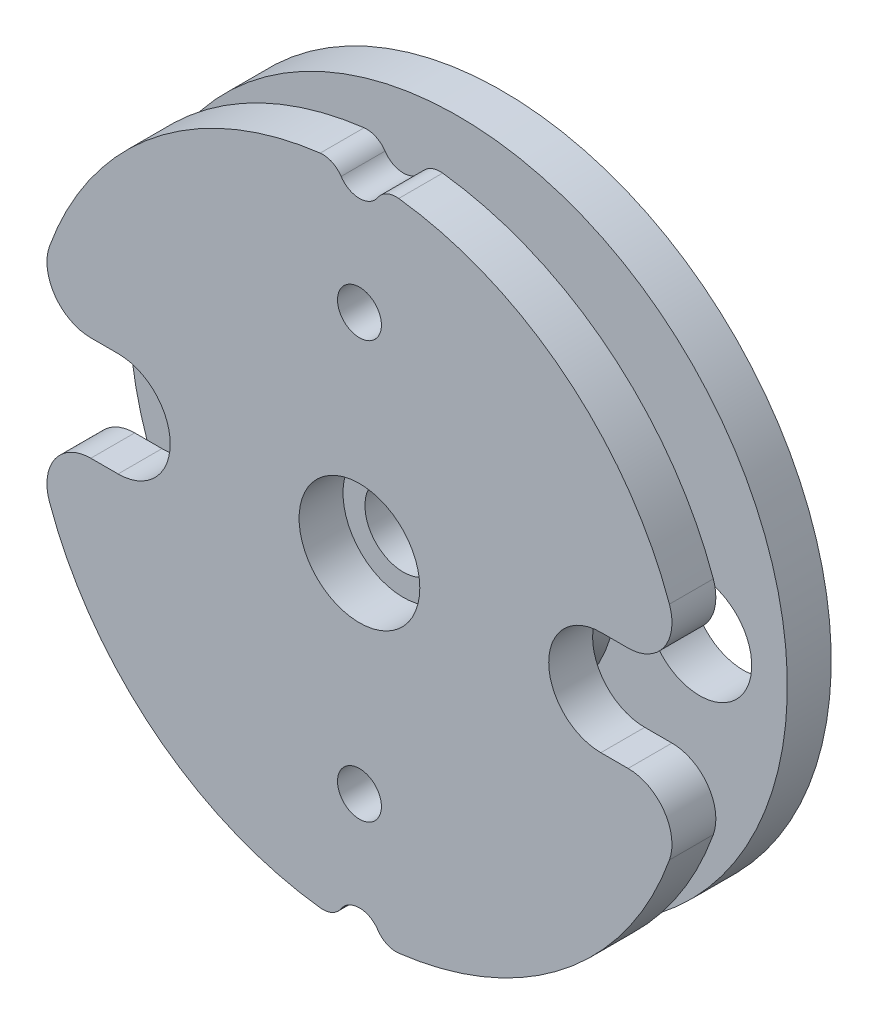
ISO-10303-21;
HEADER;
FILE_DESCRIPTION(('STEP AP214'),'2;1');
FILE_NAME('part.step','',(''),(''),'','','');
FILE_SCHEMA(('AUTOMOTIVE_DESIGN { 1 0 10303 214 1 1 1 1 }'));
ENDSEC;
DATA;
#1=APPLICATION_CONTEXT('core data for automotive mechanical design processes');
#2=APPLICATION_PROTOCOL_DEFINITION('international standard','automotive_design',2000,#1);
#3=PRODUCT_CONTEXT('',#1,'mechanical');
#4=PRODUCT('Part','Part','',(#3));
#5=PRODUCT_RELATED_PRODUCT_CATEGORY('part','',(#4));
#6=PRODUCT_DEFINITION_FORMATION('','',#4);
#7=PRODUCT_DEFINITION_CONTEXT('part definition',#1,'design');
#8=PRODUCT_DEFINITION('design','',#6,#7);
#9=PRODUCT_DEFINITION_SHAPE('','',#8);
#10=(LENGTH_UNIT() NAMED_UNIT(*) SI_UNIT(.MILLI.,.METRE.));
#11=(NAMED_UNIT(*) PLANE_ANGLE_UNIT() SI_UNIT($,.RADIAN.));
#12=(NAMED_UNIT(*) SI_UNIT($,.STERADIAN.) SOLID_ANGLE_UNIT());
#13=UNCERTAINTY_MEASURE_WITH_UNIT(LENGTH_MEASURE(1.E-05),#10,'distance_accuracy_value','');
#14=(GEOMETRIC_REPRESENTATION_CONTEXT(3) GLOBAL_UNCERTAINTY_ASSIGNED_CONTEXT((#13)) GLOBAL_UNIT_ASSIGNED_CONTEXT((#10,
#11,#12)) REPRESENTATION_CONTEXT('',''));
#15=CARTESIAN_POINT('',(0.,0.,0.));
#16=DIRECTION('',(0.,0.,1.));
#17=DIRECTION('',(1.,0.,0.));
#18=AXIS2_PLACEMENT_3D('',#15,#16,#17);
#19=CARTESIAN_POINT('',(0.,0.,3.25));
#20=DIRECTION('',(0.,0.,-1.));
#21=DIRECTION('',(-1.,0.,0.));
#22=AXIS2_PLACEMENT_3D('',#19,#20,#21);
#23=CYLINDRICAL_SURFACE('',#22,15.);
#24=CARTESIAN_POINT('',(0.,0.,1.25));
#25=DIRECTION('',(0.,0.,1.));
#26=DIRECTION('',(1.,0.,0.));
#27=AXIS2_PLACEMENT_3D('',#24,#25,#26);
#28=CIRCLE('',#27,15.);
#29=CARTESIAN_POINT('',(-14.1250458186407,-5.04807692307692,1.25));
#30=VERTEX_POINT('',#29);
#31=CARTESIAN_POINT('',(-1.78963854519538,-14.8928571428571,1.25));
#32=VERTEX_POINT('',#31);
#33=EDGE_CURVE('E239',#30,#32,#28,.T.);
#34=ORIENTED_EDGE('',*,*,#33,.T.);
#35=DIRECTION('',(0.,0.,-1.));
#36=VECTOR('',#35,1.);
#37=CARTESIAN_POINT('',(-1.78963854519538,-14.8928571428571,3.25));
#38=LINE('',#37,#36);
#39=CARTESIAN_POINT('',(-1.78963854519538,-14.8928571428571,3.25));
#40=VERTEX_POINT('',#39);
#41=EDGE_CURVE('E328',#32,#40,#38,.F.);
#42=ORIENTED_EDGE('',*,*,#41,.T.);
#43=CARTESIAN_POINT('',(0.,0.,3.25));
#44=DIRECTION('',(0.,0.,1.));
#45=DIRECTION('',(1.,0.,0.));
#46=AXIS2_PLACEMENT_3D('',#43,#44,#45);
#47=CIRCLE('',#46,15.);
#48=CARTESIAN_POINT('',(-14.1250458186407,-5.04807692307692,3.25));
#49=VERTEX_POINT('',#48);
#50=EDGE_CURVE('E244',#49,#40,#47,.T.);
#51=ORIENTED_EDGE('',*,*,#50,.F.);
#52=DIRECTION('',(0.,0.,-1.));
#53=VECTOR('',#52,1.);
#54=CARTESIAN_POINT('',(-14.1250458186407,-5.04807692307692,3.25));
#55=LINE('',#54,#53);
#56=EDGE_CURVE('E290',#49,#30,#55,.T.);
#57=ORIENTED_EDGE('',*,*,#56,.T.);
#58=EDGE_LOOP('',(#34,#42,#51,#57));
#59=FACE_BOUND('',#58,.T.);
#60=ADVANCED_FACE('F32',(#59),#23,.T.);
#61=CARTESIAN_POINT('',(14.1250458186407,5.04807692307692,1.25));
#62=VERTEX_POINT('',#61);
#63=CARTESIAN_POINT('',(1.78963854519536,14.8928571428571,1.25));
#64=VERTEX_POINT('',#63);
#65=EDGE_CURVE('E238',#62,#64,#28,.T.);
#66=ORIENTED_EDGE('',*,*,#65,.T.);
#67=DIRECTION('',(0.,0.,-1.));
#68=VECTOR('',#67,1.);
#69=CARTESIAN_POINT('',(1.78963854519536,14.8928571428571,3.25));
#70=LINE('',#69,#68);
#71=CARTESIAN_POINT('',(1.78963854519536,14.8928571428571,3.25));
#72=VERTEX_POINT('',#71);
#73=EDGE_CURVE('E325',#64,#72,#70,.F.);
#74=ORIENTED_EDGE('',*,*,#73,.T.);
#75=CARTESIAN_POINT('',(14.1250458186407,5.04807692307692,3.25));
#76=VERTEX_POINT('',#75);
#77=EDGE_CURVE('E248',#76,#72,#47,.T.);
#78=ORIENTED_EDGE('',*,*,#77,.F.);
#79=DIRECTION('',(0.,0.,-1.));
#80=VECTOR('',#79,1.);
#81=CARTESIAN_POINT('',(14.1250458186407,5.04807692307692,3.25));
#82=LINE('',#81,#80);
#83=EDGE_CURVE('E265',#76,#62,#82,.T.);
#84=ORIENTED_EDGE('',*,*,#83,.T.);
#85=EDGE_LOOP('',(#66,#74,#78,#84));
#86=FACE_BOUND('',#85,.T.);
#87=ADVANCED_FACE('F406',(#86),#23,.T.);
#88=CARTESIAN_POINT('',(-1.78963854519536,14.8928571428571,3.25));
#89=VERTEX_POINT('',#88);
#90=CARTESIAN_POINT('',(-14.1250458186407,5.04807692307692,3.25));
#91=VERTEX_POINT('',#90);
#92=EDGE_CURVE('E246',#89,#91,#47,.T.);
#93=ORIENTED_EDGE('',*,*,#92,.F.);
#94=DIRECTION('',(0.,0.,-1.));
#95=VECTOR('',#94,1.);
#96=CARTESIAN_POINT('',(-1.78963854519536,14.8928571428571,3.25));
#97=LINE('',#96,#95);
#98=CARTESIAN_POINT('',(-1.78963854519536,14.8928571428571,1.25));
#99=VERTEX_POINT('',#98);
#100=EDGE_CURVE('E304',#89,#99,#97,.T.);
#101=ORIENTED_EDGE('',*,*,#100,.T.);
#102=CARTESIAN_POINT('',(-14.1250458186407,5.04807692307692,1.25));
#103=VERTEX_POINT('',#102);
#104=EDGE_CURVE('E242',#99,#103,#28,.T.);
#105=ORIENTED_EDGE('',*,*,#104,.T.);
#106=DIRECTION('',(0.,0.,-1.));
#107=VECTOR('',#106,1.);
#108=CARTESIAN_POINT('',(-14.1250458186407,5.04807692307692,3.25));
#109=LINE('',#108,#107);
#110=EDGE_CURVE('E282',#103,#91,#109,.F.);
#111=ORIENTED_EDGE('',*,*,#110,.T.);
#112=EDGE_LOOP('',(#93,#101,#105,#111));
#113=FACE_BOUND('',#112,.T.);
#114=ADVANCED_FACE('F460',(#113),#23,.T.);
#115=CARTESIAN_POINT('',(0.,0.,-3.25));
#116=DIRECTION('',(0.,0.,1.));
#117=DIRECTION('',(1.,0.,0.));
#118=AXIS2_PLACEMENT_3D('',#115,#116,#117);
#119=CYLINDRICAL_SURFACE('',#118,1.75);
#120=CARTESIAN_POINT('',(0.,0.,-1.45));
#121=DIRECTION('',(0.,0.,-1.));
#122=DIRECTION('',(-1.,0.,0.));
#123=AXIS2_PLACEMENT_3D('',#120,#121,#122);
#124=CIRCLE('',#123,1.75);
#125=CARTESIAN_POINT('',(1.75,0.,-1.45));
#126=VERTEX_POINT('',#125);
#127=EDGE_CURVE('E230',#126,#126,#124,.F.);
#128=CARTESIAN_POINT('',(0.,0.,1.25));
#129=DIRECTION('',(0.,0.,1.));
#130=DIRECTION('',(1.,0.,0.));
#131=AXIS2_PLACEMENT_3D('',#128,#129,#130);
#132=CIRCLE('',#131,1.75);
#133=CARTESIAN_POINT('',(1.75,0.,1.25));
#134=VERTEX_POINT('',#133);
#135=EDGE_CURVE('E224',#134,#134,#132,.F.);
#136=CARTESIAN_POINT('',(1.75,0.,-1.45));
#137=CARTESIAN_POINT('',(1.75,0.,-1.421875));
#138=CARTESIAN_POINT('',(1.75,0.,-1.39375));
#139=CARTESIAN_POINT('',(1.75,0.,-1.3375));
#140=CARTESIAN_POINT('',(1.75,0.,-1.309375));
#141=CARTESIAN_POINT('',(1.75,0.,-1.253125));
#142=CARTESIAN_POINT('',(1.75,0.,-1.225));
#143=CARTESIAN_POINT('',(1.75,0.,-1.16875));
#144=CARTESIAN_POINT('',(1.75,0.,-1.140625));
#145=CARTESIAN_POINT('',(1.75,0.,-1.084375));
#146=CARTESIAN_POINT('',(1.75,0.,-1.05625));
#147=CARTESIAN_POINT('',(1.75,0.,-1.));
#148=CARTESIAN_POINT('',(1.75,0.,-0.971875));
#149=CARTESIAN_POINT('',(1.75,0.,-0.915625));
#150=CARTESIAN_POINT('',(1.75,0.,-0.8875));
#151=CARTESIAN_POINT('',(1.75,0.,-0.83125));
#152=CARTESIAN_POINT('',(1.75,0.,-0.803125));
#153=CARTESIAN_POINT('',(1.75,0.,-0.746875));
#154=CARTESIAN_POINT('',(1.75,0.,-0.71875));
#155=CARTESIAN_POINT('',(1.75,0.,-0.6625));
#156=CARTESIAN_POINT('',(1.75,0.,-0.634375));
#157=CARTESIAN_POINT('',(1.75,0.,-0.578125));
#158=CARTESIAN_POINT('',(1.75,0.,-0.55));
#159=CARTESIAN_POINT('',(1.75,0.,-0.49375));
#160=CARTESIAN_POINT('',(1.75,0.,-0.465625));
#161=CARTESIAN_POINT('',(1.75,0.,-0.409375));
#162=CARTESIAN_POINT('',(1.75,0.,-0.38125));
#163=CARTESIAN_POINT('',(1.75,0.,-0.325));
#164=CARTESIAN_POINT('',(1.75,0.,-0.296875));
#165=CARTESIAN_POINT('',(1.75,0.,-0.240625));
#166=CARTESIAN_POINT('',(1.75,0.,-0.2125));
#167=CARTESIAN_POINT('',(1.75,0.,-0.15625));
#168=CARTESIAN_POINT('',(1.75,0.,-0.128125));
#169=CARTESIAN_POINT('',(1.75,0.,-0.0718749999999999));
#170=CARTESIAN_POINT('',(1.75,0.,-0.04375));
#171=CARTESIAN_POINT('',(1.75,0.,0.0125000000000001));
#172=CARTESIAN_POINT('',(1.75,0.,0.0406250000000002));
#173=CARTESIAN_POINT('',(1.75,0.,0.0968750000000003));
#174=CARTESIAN_POINT('',(1.75,0.,0.125));
#175=CARTESIAN_POINT('',(1.75,0.,0.18125));
#176=CARTESIAN_POINT('',(1.75,0.,0.209375));
#177=CARTESIAN_POINT('',(1.75,0.,0.265625));
#178=CARTESIAN_POINT('',(1.75,0.,0.29375));
#179=CARTESIAN_POINT('',(1.75,0.,0.35));
#180=CARTESIAN_POINT('',(1.75,0.,0.378125));
#181=CARTESIAN_POINT('',(1.75,0.,0.434375));
#182=CARTESIAN_POINT('',(1.75,0.,0.4625));
#183=CARTESIAN_POINT('',(1.75,0.,0.51875));
#184=CARTESIAN_POINT('',(1.75,0.,0.546875));
#185=CARTESIAN_POINT('',(1.75,0.,0.603125));
#186=CARTESIAN_POINT('',(1.75,0.,0.63125));
#187=CARTESIAN_POINT('',(1.75,0.,0.6875));
#188=CARTESIAN_POINT('',(1.75,0.,0.715625));
#189=CARTESIAN_POINT('',(1.75,0.,0.771875));
#190=CARTESIAN_POINT('',(1.75,0.,0.8));
#191=CARTESIAN_POINT('',(1.75,0.,0.85625));
#192=CARTESIAN_POINT('',(1.75,0.,0.884375));
#193=CARTESIAN_POINT('',(1.75,0.,0.940625));
#194=CARTESIAN_POINT('',(1.75,0.,0.96875));
#195=CARTESIAN_POINT('',(1.75,0.,1.025));
#196=CARTESIAN_POINT('',(1.75,0.,1.053125));
#197=CARTESIAN_POINT('',(1.75,0.,1.109375));
#198=CARTESIAN_POINT('',(1.75,0.,1.1375));
#199=CARTESIAN_POINT('',(1.75,0.,1.19375));
#200=CARTESIAN_POINT('',(1.75,0.,1.221875));
#201=CARTESIAN_POINT('',(1.75,0.,1.25));
#202=B_SPLINE_CURVE_WITH_KNOTS('',3,(#136,#137,#138,#139,#140,#141,#142,#143,#144,#145,#146,
#147,#148,#149,#150,#151,#152,#153,#154,#155,#156,#157,#158,#159,#160,#161,#162,#163,#164,#165,
#166,#167,#168,#169,#170,#171,#172,#173,#174,#175,#176,#177,#178,#179,#180,#181,#182,#183,#184,
#185,#186,#187,#188,#189,#190,#191,#192,#193,#194,#195,#196,#197,#198,#199,#200,#201),
.UNSPECIFIED.,.F.,.F.,(4,2,2,2,2,2,2,2,2,2,2,2,2,2,2,2,2,2,2,2,2,2,2,2,2,2,2,2,2,2,2,2,4),(0.,
0.084375,0.16875,0.253125,0.3375,0.421875,0.50625,0.590625,0.675,0.759375,0.84375,0.928125,
1.0125,1.096875,1.18125,1.265625,1.35,1.434375,1.51875,1.603125,1.6875,1.771875,1.85625,
1.940625,2.025,2.109375,2.19375,2.278125,2.3625,2.446875,2.53125,2.615625,2.7),.UNSPECIFIED.);
#203=EDGE_CURVE('BSEAM475',#126,#134,#202,.T.);
#204=ORIENTED_EDGE('',*,*,#127,.F.);
#205=ORIENTED_EDGE('',*,*,#135,.F.);
#206=ORIENTED_EDGE('',*,*,#203,.T.);
#207=ORIENTED_EDGE('',*,*,#203,.F.);
#208=EDGE_LOOP('',(#204,#206,#205,#207));
#209=FACE_BOUND('',#208,.T.);
#210=ADVANCED_FACE('F475',(#209),#119,.F.);
#211=CARTESIAN_POINT('',(0.,0.,-3.25));
#212=DIRECTION('',(0.,0.,1.));
#213=DIRECTION('',(1.,0.,0.));
#214=AXIS2_PLACEMENT_3D('',#211,#212,#213);
#215=CIRCLE('',#214,15.);
#216=CARTESIAN_POINT('',(-15.,0.,-3.25));
#217=VERTEX_POINT('',#216);
#218=EDGE_CURVE('E237',#217,#217,#215,.T.);
#219=CARTESIAN_POINT('',(0.,0.,-1.25));
#220=DIRECTION('',(0.,0.,1.));
#221=DIRECTION('',(1.,0.,0.));
#222=AXIS2_PLACEMENT_3D('',#219,#220,#221);
#223=CIRCLE('',#222,15.);
#224=CARTESIAN_POINT('',(-15.,0.,-1.25));
#225=VERTEX_POINT('',#224);
#226=EDGE_CURVE('E234',#225,#225,#223,.T.);
#227=CARTESIAN_POINT('',(-15.,0.,-3.25));
#228=CARTESIAN_POINT('',(-15.,0.,-3.22916666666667));
#229=CARTESIAN_POINT('',(-15.,0.,-3.20833333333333));
#230=CARTESIAN_POINT('',(-15.,0.,-3.16666666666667));
#231=CARTESIAN_POINT('',(-15.,0.,-3.14583333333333));
#232=CARTESIAN_POINT('',(-15.,0.,-3.10416666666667));
#233=CARTESIAN_POINT('',(-15.,0.,-3.08333333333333));
#234=CARTESIAN_POINT('',(-15.,0.,-3.04166666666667));
#235=CARTESIAN_POINT('',(-15.,0.,-3.02083333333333));
#236=CARTESIAN_POINT('',(-15.,0.,-2.97916666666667));
#237=CARTESIAN_POINT('',(-15.,0.,-2.95833333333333));
#238=CARTESIAN_POINT('',(-15.,0.,-2.91666666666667));
#239=CARTESIAN_POINT('',(-15.,0.,-2.89583333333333));
#240=CARTESIAN_POINT('',(-15.,0.,-2.85416666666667));
#241=CARTESIAN_POINT('',(-15.,0.,-2.83333333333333));
#242=CARTESIAN_POINT('',(-15.,0.,-2.79166666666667));
#243=CARTESIAN_POINT('',(-15.,0.,-2.77083333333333));
#244=CARTESIAN_POINT('',(-15.,0.,-2.72916666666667));
#245=CARTESIAN_POINT('',(-15.,0.,-2.70833333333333));
#246=CARTESIAN_POINT('',(-15.,0.,-2.66666666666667));
#247=CARTESIAN_POINT('',(-15.,0.,-2.64583333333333));
#248=CARTESIAN_POINT('',(-15.,0.,-2.60416666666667));
#249=CARTESIAN_POINT('',(-15.,0.,-2.58333333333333));
#250=CARTESIAN_POINT('',(-15.,0.,-2.54166666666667));
#251=CARTESIAN_POINT('',(-15.,0.,-2.52083333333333));
#252=CARTESIAN_POINT('',(-15.,0.,-2.47916666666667));
#253=CARTESIAN_POINT('',(-15.,0.,-2.45833333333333));
#254=CARTESIAN_POINT('',(-15.,0.,-2.41666666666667));
#255=CARTESIAN_POINT('',(-15.,0.,-2.39583333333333));
#256=CARTESIAN_POINT('',(-15.,0.,-2.35416666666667));
#257=CARTESIAN_POINT('',(-15.,0.,-2.33333333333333));
#258=CARTESIAN_POINT('',(-15.,0.,-2.29166666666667));
#259=CARTESIAN_POINT('',(-15.,0.,-2.27083333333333));
#260=CARTESIAN_POINT('',(-15.,0.,-2.22916666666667));
#261=CARTESIAN_POINT('',(-15.,0.,-2.20833333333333));
#262=CARTESIAN_POINT('',(-15.,0.,-2.16666666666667));
#263=CARTESIAN_POINT('',(-15.,0.,-2.14583333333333));
#264=CARTESIAN_POINT('',(-15.,0.,-2.10416666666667));
#265=CARTESIAN_POINT('',(-15.,0.,-2.08333333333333));
#266=CARTESIAN_POINT('',(-15.,0.,-2.04166666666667));
#267=CARTESIAN_POINT('',(-15.,0.,-2.02083333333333));
#268=CARTESIAN_POINT('',(-15.,0.,-1.97916666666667));
#269=CARTESIAN_POINT('',(-15.,0.,-1.95833333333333));
#270=CARTESIAN_POINT('',(-15.,0.,-1.91666666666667));
#271=CARTESIAN_POINT('',(-15.,0.,-1.89583333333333));
#272=CARTESIAN_POINT('',(-15.,0.,-1.85416666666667));
#273=CARTESIAN_POINT('',(-15.,0.,-1.83333333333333));
#274=CARTESIAN_POINT('',(-15.,0.,-1.79166666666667));
#275=CARTESIAN_POINT('',(-15.,0.,-1.77083333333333));
#276=CARTESIAN_POINT('',(-15.,0.,-1.72916666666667));
#277=CARTESIAN_POINT('',(-15.,0.,-1.70833333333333));
#278=CARTESIAN_POINT('',(-15.,0.,-1.66666666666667));
#279=CARTESIAN_POINT('',(-15.,0.,-1.64583333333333));
#280=CARTESIAN_POINT('',(-15.,0.,-1.60416666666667));
#281=CARTESIAN_POINT('',(-15.,0.,-1.58333333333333));
#282=CARTESIAN_POINT('',(-15.,0.,-1.54166666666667));
#283=CARTESIAN_POINT('',(-15.,0.,-1.52083333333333));
#284=CARTESIAN_POINT('',(-15.,0.,-1.47916666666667));
#285=CARTESIAN_POINT('',(-15.,0.,-1.45833333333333));
#286=CARTESIAN_POINT('',(-15.,0.,-1.41666666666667));
#287=CARTESIAN_POINT('',(-15.,0.,-1.39583333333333));
#288=CARTESIAN_POINT('',(-15.,0.,-1.35416666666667));
#289=CARTESIAN_POINT('',(-15.,0.,-1.33333333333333));
#290=CARTESIAN_POINT('',(-15.,0.,-1.29166666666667));
#291=CARTESIAN_POINT('',(-15.,0.,-1.27083333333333));
#292=CARTESIAN_POINT('',(-15.,0.,-1.25));
#293=B_SPLINE_CURVE_WITH_KNOTS('',3,(#227,#228,#229,#230,#231,#232,#233,#234,#235,#236,#237,
#238,#239,#240,#241,#242,#243,#244,#245,#246,#247,#248,#249,#250,#251,#252,#253,#254,#255,#256,
#257,#258,#259,#260,#261,#262,#263,#264,#265,#266,#267,#268,#269,#270,#271,#272,#273,#274,#275,
#276,#277,#278,#279,#280,#281,#282,#283,#284,#285,#286,#287,#288,#289,#290,#291,#292),
.UNSPECIFIED.,.F.,.F.,(4,2,2,2,2,2,2,2,2,2,2,2,2,2,2,2,2,2,2,2,2,2,2,2,2,2,2,2,2,2,2,2,4),(0.,
0.0625000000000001,0.125,0.1875,0.25,0.3125,0.375,0.4375,0.5,0.5625,0.625,0.6875,0.75,0.8125,
0.875,0.9375,1.,1.0625,1.125,1.1875,1.25,1.3125,1.375,1.4375,1.5,1.5625,1.625,1.6875,1.75,
1.8125,1.875,1.9375,2.),.UNSPECIFIED.);
#294=EDGE_CURVE('BSEAM465',#217,#225,#293,.T.);
#295=ORIENTED_EDGE('',*,*,#218,.T.);
#296=ORIENTED_EDGE('',*,*,#226,.F.);
#297=ORIENTED_EDGE('',*,*,#294,.T.);
#298=ORIENTED_EDGE('',*,*,#294,.F.);
#299=EDGE_LOOP('',(#295,#297,#296,#298));
#300=FACE_BOUND('',#299,.T.);
#301=ADVANCED_FACE('F465',(#300),#23,.T.);
#302=CARTESIAN_POINT('',(0.,0.,-3.25));
#303=DIRECTION('',(0.,0.,1.));
#304=DIRECTION('',(1.,0.,0.));
#305=AXIS2_PLACEMENT_3D('',#302,#303,#304);
#306=PLANE('',#305);
#307=CARTESIAN_POINT('',(-11.,0.,-3.25));
#308=DIRECTION('',(0.,0.,-1.));
#309=DIRECTION('',(1.,0.,0.));
#310=AXIS2_PLACEMENT_3D('',#307,#308,#309);
#311=CIRCLE('',#310,2.375);
#312=CARTESIAN_POINT('',(-13.375,0.,-3.25));
#313=VERTEX_POINT('',#312);
#314=EDGE_CURVE('E195',#313,#313,#311,.T.);
#315=ORIENTED_EDGE('',*,*,#314,.F.);
#316=EDGE_LOOP('',(#315));
#317=FACE_BOUND('',#316,.T.);
#318=CARTESIAN_POINT('',(11.,0.,-3.25));
#319=DIRECTION('',(0.,0.,-1.));
#320=DIRECTION('',(-1.,0.,0.));
#321=AXIS2_PLACEMENT_3D('',#318,#319,#320);
#322=CIRCLE('',#321,2.375);
#323=CARTESIAN_POINT('',(8.625,0.,-3.25));
#324=VERTEX_POINT('',#323);
#325=EDGE_CURVE('E208',#324,#324,#322,.T.);
#326=ORIENTED_EDGE('',*,*,#325,.F.);
#327=EDGE_LOOP('',(#326));
#328=FACE_BOUND('',#327,.T.);
#329=CARTESIAN_POINT('',(0.,0.,-3.25));
#330=DIRECTION('',(0.,0.,-1.));
#331=DIRECTION('',(-1.,0.,0.));
#332=AXIS2_PLACEMENT_3D('',#329,#330,#331);
#333=CIRCLE('',#332,5.25);
#334=CARTESIAN_POINT('',(-5.25,0.,-3.25));
#335=VERTEX_POINT('',#334);
#336=EDGE_CURVE('E231',#335,#335,#333,.T.);
#337=ORIENTED_EDGE('',*,*,#336,.F.);
#338=EDGE_LOOP('',(#337));
#339=FACE_BOUND('',#338,.T.);
#340=ORIENTED_EDGE('',*,*,#218,.F.);
#341=EDGE_LOOP('',(#340));
#342=FACE_BOUND('',#341,.T.);
#343=ADVANCED_FACE('F449',(#317,#328,#339,#342),#306,.F.);
#344=CARTESIAN_POINT('',(0.,0.,-1.25));
#345=DIRECTION('',(0.,0.,1.));
#346=DIRECTION('',(1.,0.,0.));
#347=AXIS2_PLACEMENT_3D('',#344,#345,#346);
#348=PLANE('',#347);
#349=CARTESIAN_POINT('',(0.,0.,-1.25));
#350=DIRECTION('',(0.,0.,1.));
#351=DIRECTION('',(1.,0.,0.));
#352=AXIS2_PLACEMENT_3D('',#349,#350,#351);
#353=CIRCLE('',#352,7.25);
#354=CARTESIAN_POINT('',(7.25,0.,-1.25));
#355=VERTEX_POINT('',#354);
#356=EDGE_CURVE('E301',#355,#355,#353,.F.);
#357=ORIENTED_EDGE('',*,*,#356,.T.);
#358=EDGE_LOOP('',(#357));
#359=FACE_BOUND('',#358,.T.);
#360=CARTESIAN_POINT('',(-11.,0.,-1.25));
#361=DIRECTION('',(0.,0.,1.));
#362=DIRECTION('',(1.,0.,0.));
#363=AXIS2_PLACEMENT_3D('',#360,#361,#362);
#364=CIRCLE('',#363,2.375);
#365=CARTESIAN_POINT('',(-13.375,0.,-1.25));
#366=VERTEX_POINT('',#365);
#367=EDGE_CURVE('E197',#366,#366,#364,.T.);
#368=ORIENTED_EDGE('',*,*,#367,.F.);
#369=EDGE_LOOP('',(#368));
#370=FACE_BOUND('',#369,.T.);
#371=CARTESIAN_POINT('',(11.,0.,-1.25));
#372=DIRECTION('',(0.,0.,1.));
#373=DIRECTION('',(1.,0.,0.));
#374=AXIS2_PLACEMENT_3D('',#371,#372,#373);
#375=CIRCLE('',#374,2.375);
#376=CARTESIAN_POINT('',(8.625,0.,-1.25));
#377=VERTEX_POINT('',#376);
#378=EDGE_CURVE('E217',#377,#377,#375,.T.);
#379=ORIENTED_EDGE('',*,*,#378,.F.);
#380=EDGE_LOOP('',(#379));
#381=FACE_BOUND('',#380,.T.);
#382=ORIENTED_EDGE('',*,*,#226,.T.);
#383=EDGE_LOOP('',(#382));
#384=FACE_BOUND('',#383,.T.);
#385=ADVANCED_FACE('F438',(#359,#370,#381,#384),#348,.T.);
#386=CARTESIAN_POINT('',(0.,0.,1.25));
#387=DIRECTION('',(0.,0.,1.));
#388=DIRECTION('',(1.,0.,0.));
#389=AXIS2_PLACEMENT_3D('',#386,#387,#388);
#390=PLANE('',#389);
#391=CARTESIAN_POINT('',(0.,0.,1.25));
#392=DIRECTION('',(0.,0.,1.));
#393=DIRECTION('',(1.,0.,0.));
#394=AXIS2_PLACEMENT_3D('',#391,#392,#393);
#395=CIRCLE('',#394,7.25000000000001);
#396=CARTESIAN_POINT('',(7.25000000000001,0.,1.25));
#397=VERTEX_POINT('',#396);
#398=EDGE_CURVE('E292',#397,#397,#395,.T.);
#399=ORIENTED_EDGE('',*,*,#398,.T.);
#400=EDGE_LOOP('',(#399));
#401=FACE_BOUND('',#400,.T.);
#402=CARTESIAN_POINT('',(0.,-9.5,1.25));
#403=DIRECTION('',(0.,0.,1.));
#404=DIRECTION('',(1.,0.,0.));
#405=AXIS2_PLACEMENT_3D('',#402,#403,#404);
#406=CIRCLE('',#405,1.);
#407=CARTESIAN_POINT('',(1.,-9.5,1.25));
#408=VERTEX_POINT('',#407);
#409=EDGE_CURVE('E413',#408,#408,#406,.F.);
#410=ORIENTED_EDGE('',*,*,#409,.F.);
#411=EDGE_LOOP('',(#410));
#412=FACE_BOUND('',#411,.T.);
#413=CARTESIAN_POINT('',(0.,9.5,1.25));
#414=DIRECTION('',(0.,0.,1.));
#415=DIRECTION('',(1.,0.,0.));
#416=AXIS2_PLACEMENT_3D('',#413,#414,#415);
#417=CIRCLE('',#416,1.);
#418=CARTESIAN_POINT('',(1.,9.5,1.25));
#419=VERTEX_POINT('',#418);
#420=EDGE_CURVE('E428',#419,#419,#417,.F.);
#421=ORIENTED_EDGE('',*,*,#420,.F.);
#422=EDGE_LOOP('',(#421));
#423=FACE_BOUND('',#422,.T.);
#424=ORIENTED_EDGE('',*,*,#104,.F.);
#425=CARTESIAN_POINT('',(-1.670329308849,13.9,1.25));
#426=DIRECTION('',(0.,0.,1.));
#427=DIRECTION('',(1.,0.,0.));
#428=AXIS2_PLACEMENT_3D('',#425,#426,#427);
#429=CIRCLE('',#428,1.);
#430=CARTESIAN_POINT('',(-0.835164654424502,14.45,1.25));
#431=VERTEX_POINT('',#430);
#432=EDGE_CURVE('E313',#99,#431,#429,.F.);
#433=ORIENTED_EDGE('',*,*,#432,.T.);
#434=CARTESIAN_POINT('',(0.,15.,1.25));
#435=DIRECTION('',(0.,0.,1.));
#436=DIRECTION('',(1.,0.,0.));
#437=AXIS2_PLACEMENT_3D('',#434,#435,#436);
#438=CIRCLE('',#437,1.);
#439=CARTESIAN_POINT('',(0.835164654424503,14.45,1.25));
#440=VERTEX_POINT('',#439);
#441=EDGE_CURVE('E422',#440,#431,#438,.F.);
#442=ORIENTED_EDGE('',*,*,#441,.F.);
#443=CARTESIAN_POINT('',(1.670329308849,13.9,1.25));
#444=DIRECTION('',(0.,0.,1.));
#445=DIRECTION('',(1.,0.,0.));
#446=AXIS2_PLACEMENT_3D('',#443,#444,#445);
#447=CIRCLE('',#446,1.);
#448=EDGE_CURVE('E311',#440,#64,#447,.F.);
#449=ORIENTED_EDGE('',*,*,#448,.T.);
#450=ORIENTED_EDGE('',*,*,#65,.F.);
#451=CARTESIAN_POINT('',(12.2417063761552,4.375,1.25));
#452=DIRECTION('',(0.,0.,1.));
#453=DIRECTION('',(1.,0.,0.));
#454=AXIS2_PLACEMENT_3D('',#451,#452,#453);
#455=CIRCLE('',#454,2.);
#456=CARTESIAN_POINT('',(12.2417063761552,2.375,1.25));
#457=VERTEX_POINT('',#456);
#458=EDGE_CURVE('E275',#62,#457,#455,.F.);
#459=ORIENTED_EDGE('',*,*,#458,.T.);
#460=DIRECTION('',(1.,0.,0.));
#461=VECTOR('',#460,1.);
#462=CARTESIAN_POINT('',(11.,2.375,1.25));
#463=LINE('',#462,#461);
#464=CARTESIAN_POINT('',(11.,2.375,1.25));
#465=VERTEX_POINT('',#464);
#466=EDGE_CURVE('E371',#465,#457,#463,.T.);
#467=ORIENTED_EDGE('',*,*,#466,.F.);
#468=CARTESIAN_POINT('',(11.,0.,1.25));
#469=DIRECTION('',(0.,0.,1.));
#470=DIRECTION('',(1.,0.,0.));
#471=AXIS2_PLACEMENT_3D('',#468,#469,#470);
#472=CIRCLE('',#471,2.375);
#473=CARTESIAN_POINT('',(11.,-2.375,1.25));
#474=VERTEX_POINT('',#473);
#475=EDGE_CURVE('E212',#465,#474,#472,.T.);
#476=ORIENTED_EDGE('',*,*,#475,.T.);
#477=DIRECTION('',(-1.,0.,0.));
#478=VECTOR('',#477,1.);
#479=CARTESIAN_POINT('',(11.,-2.375,1.25));
#480=LINE('',#479,#478);
#481=CARTESIAN_POINT('',(12.2417063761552,-2.375,1.25));
#482=VERTEX_POINT('',#481);
#483=EDGE_CURVE('E200',#482,#474,#480,.T.);
#484=ORIENTED_EDGE('',*,*,#483,.F.);
#485=CARTESIAN_POINT('',(12.2417063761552,-4.375,1.25));
#486=DIRECTION('',(0.,0.,1.));
#487=DIRECTION('',(1.,0.,0.));
#488=AXIS2_PLACEMENT_3D('',#485,#486,#487);
#489=CIRCLE('',#488,2.);
#490=CARTESIAN_POINT('',(14.1250458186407,-5.04807692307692,1.25));
#491=VERTEX_POINT('',#490);
#492=EDGE_CURVE('E272',#482,#491,#489,.F.);
#493=ORIENTED_EDGE('',*,*,#492,.T.);
#494=CARTESIAN_POINT('',(1.78963854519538,-14.8928571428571,1.25));
#495=VERTEX_POINT('',#494);
#496=EDGE_CURVE('E243',#495,#491,#28,.T.);
#497=ORIENTED_EDGE('',*,*,#496,.F.);
#498=CARTESIAN_POINT('',(1.67032930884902,-13.9,1.25));
#499=DIRECTION('',(0.,0.,1.));
#500=DIRECTION('',(1.,0.,0.));
#501=AXIS2_PLACEMENT_3D('',#498,#499,#500);
#502=CIRCLE('',#501,1.);
#503=CARTESIAN_POINT('',(0.835164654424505,-14.45,1.25));
#504=VERTEX_POINT('',#503);
#505=EDGE_CURVE('E307',#495,#504,#502,.F.);
#506=ORIENTED_EDGE('',*,*,#505,.T.);
#507=CARTESIAN_POINT('',(0.,-15.,1.25));
#508=DIRECTION('',(0.,0.,1.));
#509=DIRECTION('',(1.,0.,0.));
#510=AXIS2_PLACEMENT_3D('',#507,#508,#509);
#511=CIRCLE('',#510,1.);
#512=CARTESIAN_POINT('',(-0.83516465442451,-14.45,1.25));
#513=VERTEX_POINT('',#512);
#514=EDGE_CURVE('E337',#513,#504,#511,.F.);
#515=ORIENTED_EDGE('',*,*,#514,.F.);
#516=CARTESIAN_POINT('',(-1.67032930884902,-13.9,1.25));
#517=DIRECTION('',(0.,0.,1.));
#518=DIRECTION('',(1.,0.,0.));
#519=AXIS2_PLACEMENT_3D('',#516,#517,#518);
#520=CIRCLE('',#519,1.);
#521=EDGE_CURVE('E309',#513,#32,#520,.F.);
#522=ORIENTED_EDGE('',*,*,#521,.T.);
#523=ORIENTED_EDGE('',*,*,#33,.F.);
#524=CARTESIAN_POINT('',(-12.2417063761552,-4.375,1.25));
#525=DIRECTION('',(0.,0.,1.));
#526=DIRECTION('',(1.,0.,0.));
#527=AXIS2_PLACEMENT_3D('',#524,#525,#526);
#528=CIRCLE('',#527,2.);
#529=CARTESIAN_POINT('',(-12.2417063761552,-2.375,1.25));
#530=VERTEX_POINT('',#529);
#531=EDGE_CURVE('E267',#30,#530,#528,.F.);
#532=ORIENTED_EDGE('',*,*,#531,.T.);
#533=DIRECTION('',(-1.,0.,0.));
#534=VECTOR('',#533,1.);
#535=CARTESIAN_POINT('',(-11.,-2.375,1.25));
#536=LINE('',#535,#534);
#537=CARTESIAN_POINT('',(-11.,-2.375,1.25));
#538=VERTEX_POINT('',#537);
#539=EDGE_CURVE('E362',#538,#530,#536,.T.);
#540=ORIENTED_EDGE('',*,*,#539,.F.);
#541=CARTESIAN_POINT('',(-11.,0.,1.25));
#542=DIRECTION('',(0.,0.,1.));
#543=DIRECTION('',(1.,0.,0.));
#544=AXIS2_PLACEMENT_3D('',#541,#542,#543);
#545=CIRCLE('',#544,2.375);
#546=CARTESIAN_POINT('',(-11.,2.375,1.25));
#547=VERTEX_POINT('',#546);
#548=EDGE_CURVE('E194',#538,#547,#545,.T.);
#549=ORIENTED_EDGE('',*,*,#548,.T.);
#550=DIRECTION('',(1.,0.,0.));
#551=VECTOR('',#550,1.);
#552=CARTESIAN_POINT('',(-11.,2.375,1.25));
#553=LINE('',#552,#551);
#554=CARTESIAN_POINT('',(-12.2417063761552,2.375,1.25));
#555=VERTEX_POINT('',#554);
#556=EDGE_CURVE('E175',#555,#547,#553,.T.);
#557=ORIENTED_EDGE('',*,*,#556,.F.);
#558=CARTESIAN_POINT('',(-12.2417063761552,4.375,1.25));
#559=DIRECTION('',(0.,0.,1.));
#560=DIRECTION('',(1.,0.,0.));
#561=AXIS2_PLACEMENT_3D('',#558,#559,#560);
#562=CIRCLE('',#561,2.);
#563=EDGE_CURVE('E269',#555,#103,#562,.F.);
#564=ORIENTED_EDGE('',*,*,#563,.T.);
#565=EDGE_LOOP('',(#424,#433,#442,#449,#450,#459,#467,#476,#484,#493,#497,#506,#515,#522,#523,
#532,#540,#549,#557,#564));
#566=FACE_BOUND('',#565,.T.);
#567=ADVANCED_FACE('F344',(#401,#412,#423,#566),#390,.F.);
#568=CARTESIAN_POINT('',(0.,0.,-1.25));
#569=DIRECTION('',(0.,0.,1.));
#570=DIRECTION('',(1.,0.,0.));
#571=AXIS2_PLACEMENT_3D('',#568,#569,#570);
#572=CYLINDRICAL_SURFACE('',#571,6.5);
#573=CARTESIAN_POINT('',(0.,0.,0.499999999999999));
#574=DIRECTION('',(0.,0.,1.));
#575=DIRECTION('',(1.,0.,0.));
#576=AXIS2_PLACEMENT_3D('',#573,#574,#575);
#577=CIRCLE('',#576,6.5);
#578=CARTESIAN_POINT('',(6.5,0.,0.499999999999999));
#579=VERTEX_POINT('',#578);
#580=EDGE_CURVE('E298',#579,#579,#577,.F.);
#581=ORIENTED_EDGE('',*,*,#580,.T.);
#582=EDGE_LOOP('',(#581));
#583=FACE_BOUND('',#582,.T.);
#584=CARTESIAN_POINT('',(0.,0.,-0.499999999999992));
#585=DIRECTION('',(0.,0.,1.));
#586=DIRECTION('',(1.,0.,0.));
#587=AXIS2_PLACEMENT_3D('',#584,#585,#586);
#588=CIRCLE('',#587,6.5);
#589=CARTESIAN_POINT('',(6.5,0.,-0.499999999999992));
#590=VERTEX_POINT('',#589);
#591=EDGE_CURVE('E295',#590,#590,#588,.T.);
#592=ORIENTED_EDGE('',*,*,#591,.T.);
#593=EDGE_LOOP('',(#592));
#594=FACE_BOUND('',#593,.T.);
#595=ADVANCED_FACE('F437',(#583,#594),#572,.T.);
#596=CARTESIAN_POINT('',(0.,0.,3.25));
#597=DIRECTION('',(0.,0.,1.));
#598=DIRECTION('',(1.,0.,0.));
#599=AXIS2_PLACEMENT_3D('',#596,#597,#598);
#600=PLANE('',#599);
#601=CARTESIAN_POINT('',(0.,-9.5,3.25));
#602=DIRECTION('',(0.,0.,1.));
#603=DIRECTION('',(-1.,0.,0.));
#604=AXIS2_PLACEMENT_3D('',#601,#602,#603);
#605=CIRCLE('',#604,1.);
#606=CARTESIAN_POINT('',(-1.,-9.5,3.25));
#607=VERTEX_POINT('',#606);
#608=EDGE_CURVE('E416',#607,#607,#605,.T.);
#609=ORIENTED_EDGE('',*,*,#608,.F.);
#610=EDGE_LOOP('',(#609));
#611=FACE_BOUND('',#610,.T.);
#612=CARTESIAN_POINT('',(0.,15.,3.25));
#613=DIRECTION('',(0.,0.,1.));
#614=DIRECTION('',(1.,0.,0.));
#615=AXIS2_PLACEMENT_3D('',#612,#613,#614);
#616=CIRCLE('',#615,1.);
#617=CARTESIAN_POINT('',(-0.835164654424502,14.45,3.25));
#618=VERTEX_POINT('',#617);
#619=CARTESIAN_POINT('',(0.835164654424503,14.45,3.25));
#620=VERTEX_POINT('',#619);
#621=EDGE_CURVE('E347',#618,#620,#616,.T.);
#622=ORIENTED_EDGE('',*,*,#621,.F.);
#623=CARTESIAN_POINT('',(-1.670329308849,13.9,3.25));
#624=DIRECTION('',(0.,0.,1.));
#625=DIRECTION('',(1.,0.,0.));
#626=AXIS2_PLACEMENT_3D('',#623,#624,#625);
#627=CIRCLE('',#626,1.);
#628=EDGE_CURVE('E323',#618,#89,#627,.T.);
#629=ORIENTED_EDGE('',*,*,#628,.T.);
#630=ORIENTED_EDGE('',*,*,#92,.T.);
#631=CARTESIAN_POINT('',(-12.2417063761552,4.375,3.25));
#632=DIRECTION('',(0.,0.,1.));
#633=DIRECTION('',(1.,0.,0.));
#634=AXIS2_PLACEMENT_3D('',#631,#632,#633);
#635=CIRCLE('',#634,2.);
#636=CARTESIAN_POINT('',(-12.2417063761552,2.375,3.25));
#637=VERTEX_POINT('',#636);
#638=EDGE_CURVE('E189',#91,#637,#635,.T.);
#639=ORIENTED_EDGE('',*,*,#638,.T.);
#640=DIRECTION('',(-1.,0.,0.));
#641=VECTOR('',#640,1.);
#642=CARTESIAN_POINT('',(-11.,2.375,3.25));
#643=LINE('',#642,#641);
#644=CARTESIAN_POINT('',(-11.,2.375,3.25));
#645=VERTEX_POINT('',#644);
#646=EDGE_CURVE('E172',#645,#637,#643,.T.);
#647=ORIENTED_EDGE('',*,*,#646,.F.);
#648=CARTESIAN_POINT('',(-11.,0.,3.25));
#649=DIRECTION('',(0.,0.,-1.));
#650=DIRECTION('',(1.,0.,0.));
#651=AXIS2_PLACEMENT_3D('',#648,#649,#650);
#652=CIRCLE('',#651,2.375);
#653=CARTESIAN_POINT('',(-11.,-2.375,3.25));
#654=VERTEX_POINT('',#653);
#655=EDGE_CURVE('E187',#645,#654,#652,.T.);
#656=ORIENTED_EDGE('',*,*,#655,.T.);
#657=DIRECTION('',(1.,0.,0.));
#658=VECTOR('',#657,1.);
#659=CARTESIAN_POINT('',(-11.,-2.375,3.25));
#660=LINE('',#659,#658);
#661=CARTESIAN_POINT('',(-12.2417063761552,-2.375,3.25));
#662=VERTEX_POINT('',#661);
#663=EDGE_CURVE('E190',#662,#654,#660,.T.);
#664=ORIENTED_EDGE('',*,*,#663,.F.);
#665=CARTESIAN_POINT('',(-12.2417063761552,-4.375,3.25));
#666=DIRECTION('',(0.,0.,1.));
#667=DIRECTION('',(1.,0.,0.));
#668=AXIS2_PLACEMENT_3D('',#665,#666,#667);
#669=CIRCLE('',#668,2.);
#670=EDGE_CURVE('E258',#662,#49,#669,.T.);
#671=ORIENTED_EDGE('',*,*,#670,.T.);
#672=ORIENTED_EDGE('',*,*,#50,.T.);
#673=CARTESIAN_POINT('',(-1.67032930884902,-13.9,3.25));
#674=DIRECTION('',(0.,0.,1.));
#675=DIRECTION('',(1.,0.,0.));
#676=AXIS2_PLACEMENT_3D('',#673,#674,#675);
#677=CIRCLE('',#676,1.);
#678=CARTESIAN_POINT('',(-0.83516465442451,-14.45,3.25));
#679=VERTEX_POINT('',#678);
#680=EDGE_CURVE('E53',#40,#679,#677,.T.);
#681=ORIENTED_EDGE('',*,*,#680,.T.);
#682=CARTESIAN_POINT('',(0.,-15.,3.25));
#683=DIRECTION('',(0.,0.,1.));
#684=DIRECTION('',(-1.,0.,0.));
#685=AXIS2_PLACEMENT_3D('',#682,#683,#684);
#686=CIRCLE('',#685,1.);
#687=CARTESIAN_POINT('',(0.835164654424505,-14.45,3.25));
#688=VERTEX_POINT('',#687);
#689=EDGE_CURVE('E339',#688,#679,#686,.T.);
#690=ORIENTED_EDGE('',*,*,#689,.F.);
#691=CARTESIAN_POINT('',(1.67032930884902,-13.9,3.25));
#692=DIRECTION('',(0.,0.,1.));
#693=DIRECTION('',(1.,0.,0.));
#694=AXIS2_PLACEMENT_3D('',#691,#692,#693);
#695=CIRCLE('',#694,1.);
#696=CARTESIAN_POINT('',(1.78963854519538,-14.8928571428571,3.25));
#697=VERTEX_POINT('',#696);
#698=EDGE_CURVE('E47',#688,#697,#695,.T.);
#699=ORIENTED_EDGE('',*,*,#698,.T.);
#700=CARTESIAN_POINT('',(14.1250458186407,-5.04807692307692,3.25));
#701=VERTEX_POINT('',#700);
#702=EDGE_CURVE('E247',#697,#701,#47,.T.);
#703=ORIENTED_EDGE('',*,*,#702,.T.);
#704=CARTESIAN_POINT('',(12.2417063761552,-4.375,3.25));
#705=DIRECTION('',(0.,0.,1.));
#706=DIRECTION('',(1.,0.,0.));
#707=AXIS2_PLACEMENT_3D('',#704,#705,#706);
#708=CIRCLE('',#707,2.);
#709=CARTESIAN_POINT('',(12.2417063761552,-2.375,3.25));
#710=VERTEX_POINT('',#709);
#711=EDGE_CURVE('E261',#701,#710,#708,.T.);
#712=ORIENTED_EDGE('',*,*,#711,.T.);
#713=DIRECTION('',(1.,0.,0.));
#714=VECTOR('',#713,1.);
#715=CARTESIAN_POINT('',(11.,-2.375,3.25));
#716=LINE('',#715,#714);
#717=CARTESIAN_POINT('',(11.,-2.375,3.25));
#718=VERTEX_POINT('',#717);
#719=EDGE_CURVE('E363',#718,#710,#716,.T.);
#720=ORIENTED_EDGE('',*,*,#719,.F.);
#721=CARTESIAN_POINT('',(11.,0.,3.25));
#722=DIRECTION('',(0.,0.,-1.));
#723=DIRECTION('',(-1.,0.,0.));
#724=AXIS2_PLACEMENT_3D('',#721,#722,#723);
#725=CIRCLE('',#724,2.375);
#726=CARTESIAN_POINT('',(11.,2.375,3.25));
#727=VERTEX_POINT('',#726);
#728=EDGE_CURVE('E209',#718,#727,#725,.T.);
#729=ORIENTED_EDGE('',*,*,#728,.T.);
#730=DIRECTION('',(-1.,0.,0.));
#731=VECTOR('',#730,1.);
#732=CARTESIAN_POINT('',(11.,2.375,3.25));
#733=LINE('',#732,#731);
#734=CARTESIAN_POINT('',(12.2417063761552,2.375,3.25));
#735=VERTEX_POINT('',#734);
#736=EDGE_CURVE('E366',#735,#727,#733,.T.);
#737=ORIENTED_EDGE('',*,*,#736,.F.);
#738=CARTESIAN_POINT('',(12.2417063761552,4.375,3.25));
#739=DIRECTION('',(0.,0.,1.));
#740=DIRECTION('',(1.,0.,0.));
#741=AXIS2_PLACEMENT_3D('',#738,#739,#740);
#742=CIRCLE('',#741,2.);
#743=EDGE_CURVE('E263',#735,#76,#742,.T.);
#744=ORIENTED_EDGE('',*,*,#743,.T.);
#745=ORIENTED_EDGE('',*,*,#77,.T.);
#746=CARTESIAN_POINT('',(1.670329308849,13.9,3.25));
#747=DIRECTION('',(0.,0.,1.));
#748=DIRECTION('',(1.,0.,0.));
#749=AXIS2_PLACEMENT_3D('',#746,#747,#748);
#750=CIRCLE('',#749,1.);
#751=EDGE_CURVE('E321',#72,#620,#750,.T.);
#752=ORIENTED_EDGE('',*,*,#751,.T.);
#753=EDGE_LOOP('',(#622,#629,#630,#639,#647,#656,#664,#671,#672,#681,#690,#699,#703,#712,#720,
#729,#737,#744,#745,#752));
#754=FACE_BOUND('',#753,.T.);
#755=CARTESIAN_POINT('',(0.,9.5,3.25));
#756=DIRECTION('',(0.,0.,1.));
#757=DIRECTION('',(1.,0.,0.));
#758=AXIS2_PLACEMENT_3D('',#755,#756,#757);
#759=CIRCLE('',#758,1.);
#760=CARTESIAN_POINT('',(1.,9.5,3.25));
#761=VERTEX_POINT('',#760);
#762=EDGE_CURVE('E425',#761,#761,#759,.T.);
#763=ORIENTED_EDGE('',*,*,#762,.F.);
#764=EDGE_LOOP('',(#763));
#765=FACE_BOUND('',#764,.T.);
#766=CARTESIAN_POINT('',(0.,0.,3.25));
#767=DIRECTION('',(0.,0.,1.));
#768=DIRECTION('',(1.,0.,0.));
#769=AXIS2_PLACEMENT_3D('',#766,#767,#768);
#770=CIRCLE('',#769,2.75);
#771=CARTESIAN_POINT('',(2.75,0.,3.25));
#772=VERTEX_POINT('',#771);
#773=EDGE_CURVE('E220',#772,#772,#770,.T.);
#774=ORIENTED_EDGE('',*,*,#773,.F.);
#775=EDGE_LOOP('',(#774));
#776=FACE_BOUND('',#775,.T.);
#777=ADVANCED_FACE('F184',(#611,#754,#765,#776),#600,.T.);
#778=ORIENTED_EDGE('',*,*,#702,.F.);
#779=DIRECTION('',(0.,0.,-1.));
#780=VECTOR('',#779,1.);
#781=CARTESIAN_POINT('',(1.78963854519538,-14.8928571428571,3.25));
#782=LINE('',#781,#780);
#783=EDGE_CURVE('E11',#697,#495,#782,.T.);
#784=ORIENTED_EDGE('',*,*,#783,.T.);
#785=ORIENTED_EDGE('',*,*,#496,.T.);
#786=DIRECTION('',(0.,0.,-1.));
#787=VECTOR('',#786,1.);
#788=CARTESIAN_POINT('',(14.1250458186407,-5.04807692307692,3.25));
#789=LINE('',#788,#787);
#790=EDGE_CURVE('E277',#491,#701,#789,.F.);
#791=ORIENTED_EDGE('',*,*,#790,.T.);
#792=EDGE_LOOP('',(#778,#784,#785,#791));
#793=FACE_BOUND('',#792,.T.);
#794=ADVANCED_FACE('F411',(#793),#23,.T.);
#795=CARTESIAN_POINT('',(0.,0.,-1.45));
#796=DIRECTION('',(0.,0.,-1.));
#797=DIRECTION('',(-1.,0.,0.));
#798=AXIS2_PLACEMENT_3D('',#795,#796,#797);
#799=PLANE('',#798);
#800=CARTESIAN_POINT('',(0.,0.,-1.45));
#801=DIRECTION('',(0.,0.,-1.));
#802=DIRECTION('',(-1.,0.,0.));
#803=AXIS2_PLACEMENT_3D('',#800,#801,#802);
#804=CIRCLE('',#803,5.25);
#805=CARTESIAN_POINT('',(-5.25,0.,-1.45));
#806=VERTEX_POINT('',#805);
#807=EDGE_CURVE('E227',#806,#806,#804,.T.);
#808=ORIENTED_EDGE('',*,*,#807,.T.);
#809=EDGE_LOOP('',(#808));
#810=FACE_BOUND('',#809,.T.);
#811=ORIENTED_EDGE('',*,*,#127,.T.);
#812=EDGE_LOOP('',(#811));
#813=FACE_BOUND('',#812,.T.);
#814=ADVANCED_FACE('F464',(#810,#813),#799,.T.);
#815=CARTESIAN_POINT('',(0.,0.,-1.45));
#816=DIRECTION('',(0.,0.,-1.));
#817=DIRECTION('',(-1.,0.,0.));
#818=AXIS2_PLACEMENT_3D('',#815,#816,#817);
#819=CYLINDRICAL_SURFACE('',#818,5.25);
#820=ORIENTED_EDGE('',*,*,#807,.F.);
#821=EDGE_LOOP('',(#820));
#822=FACE_BOUND('',#821,.T.);
#823=ORIENTED_EDGE('',*,*,#336,.T.);
#824=EDGE_LOOP('',(#823));
#825=FACE_BOUND('',#824,.T.);
#826=ADVANCED_FACE('F470',(#822,#825),#819,.F.);
#827=CARTESIAN_POINT('',(0.,0.,1.25));
#828=DIRECTION('',(0.,0.,1.));
#829=DIRECTION('',(1.,0.,0.));
#830=AXIS2_PLACEMENT_3D('',#827,#828,#829);
#831=PLANE('',#830);
#832=CARTESIAN_POINT('',(0.,0.,1.25));
#833=DIRECTION('',(0.,0.,1.));
#834=DIRECTION('',(1.,0.,0.));
#835=AXIS2_PLACEMENT_3D('',#832,#833,#834);
#836=CIRCLE('',#835,2.75);
#837=CARTESIAN_POINT('',(2.75,0.,1.25));
#838=VERTEX_POINT('',#837);
#839=EDGE_CURVE('E221',#838,#838,#836,.T.);
#840=ORIENTED_EDGE('',*,*,#839,.T.);
#841=EDGE_LOOP('',(#840));
#842=FACE_BOUND('',#841,.T.);
#843=ORIENTED_EDGE('',*,*,#135,.T.);
#844=EDGE_LOOP('',(#843));
#845=FACE_BOUND('',#844,.T.);
#846=ADVANCED_FACE('F648',(#842,#845),#831,.T.);
#847=CARTESIAN_POINT('',(0.,0.,1.25));
#848=DIRECTION('',(0.,0.,1.));
#849=DIRECTION('',(1.,0.,0.));
#850=AXIS2_PLACEMENT_3D('',#847,#848,#849);
#851=CYLINDRICAL_SURFACE('',#850,2.75);
#852=ORIENTED_EDGE('',*,*,#839,.F.);
#853=EDGE_LOOP('',(#852));
#854=FACE_BOUND('',#853,.T.);
#855=ORIENTED_EDGE('',*,*,#773,.T.);
#856=EDGE_LOOP('',(#855));
#857=FACE_BOUND('',#856,.T.);
#858=ADVANCED_FACE('F642',(#854,#857),#851,.F.);
#859=CARTESIAN_POINT('',(11.,0.,3.25));
#860=DIRECTION('',(0.,0.,-1.));
#861=DIRECTION('',(-1.,0.,0.));
#862=AXIS2_PLACEMENT_3D('',#859,#860,#861);
#863=CYLINDRICAL_SURFACE('',#862,2.375);
#864=ORIENTED_EDGE('',*,*,#728,.F.);
#865=DIRECTION('',(0.,0.,1.));
#866=VECTOR('',#865,1.);
#867=CARTESIAN_POINT('',(11.,-2.375,-4.95987117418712));
#868=LINE('',#867,#866);
#869=EDGE_CURVE('E374',#474,#718,#868,.T.);
#870=ORIENTED_EDGE('',*,*,#869,.F.);
#871=ORIENTED_EDGE('',*,*,#475,.F.);
#872=DIRECTION('',(0.,0.,1.));
#873=VECTOR('',#872,1.);
#874=CARTESIAN_POINT('',(11.,2.375,-4.95987117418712));
#875=LINE('',#874,#873);
#876=EDGE_CURVE('E203',#465,#727,#875,.T.);
#877=ORIENTED_EDGE('',*,*,#876,.T.);
#878=EDGE_LOOP('',(#864,#870,#871,#877));
#879=FACE_BOUND('',#878,.T.);
#880=ADVANCED_FACE('F383',(#879),#863,.F.);
#881=CARTESIAN_POINT('',(8.625,0.,-1.25));
#882=CARTESIAN_POINT('',(8.625,0.,-1.27083333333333));
#883=CARTESIAN_POINT('',(8.625,0.,-1.29166666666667));
#884=CARTESIAN_POINT('',(8.625,0.,-1.33333333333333));
#885=CARTESIAN_POINT('',(8.625,0.,-1.35416666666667));
#886=CARTESIAN_POINT('',(8.625,0.,-1.39583333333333));
#887=CARTESIAN_POINT('',(8.625,0.,-1.41666666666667));
#888=CARTESIAN_POINT('',(8.625,0.,-1.45833333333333));
#889=CARTESIAN_POINT('',(8.625,0.,-1.47916666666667));
#890=CARTESIAN_POINT('',(8.625,0.,-1.52083333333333));
#891=CARTESIAN_POINT('',(8.625,0.,-1.54166666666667));
#892=CARTESIAN_POINT('',(8.625,0.,-1.58333333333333));
#893=CARTESIAN_POINT('',(8.625,0.,-1.60416666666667));
#894=CARTESIAN_POINT('',(8.625,0.,-1.64583333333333));
#895=CARTESIAN_POINT('',(8.625,0.,-1.66666666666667));
#896=CARTESIAN_POINT('',(8.625,0.,-1.70833333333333));
#897=CARTESIAN_POINT('',(8.625,0.,-1.72916666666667));
#898=CARTESIAN_POINT('',(8.625,0.,-1.77083333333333));
#899=CARTESIAN_POINT('',(8.625,0.,-1.79166666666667));
#900=CARTESIAN_POINT('',(8.625,0.,-1.83333333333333));
#901=CARTESIAN_POINT('',(8.625,0.,-1.85416666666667));
#902=CARTESIAN_POINT('',(8.625,0.,-1.89583333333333));
#903=CARTESIAN_POINT('',(8.625,0.,-1.91666666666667));
#904=CARTESIAN_POINT('',(8.625,0.,-1.95833333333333));
#905=CARTESIAN_POINT('',(8.625,0.,-1.97916666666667));
#906=CARTESIAN_POINT('',(8.625,0.,-2.02083333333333));
#907=CARTESIAN_POINT('',(8.625,0.,-2.04166666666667));
#908=CARTESIAN_POINT('',(8.625,0.,-2.08333333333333));
#909=CARTESIAN_POINT('',(8.625,0.,-2.10416666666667));
#910=CARTESIAN_POINT('',(8.625,0.,-2.14583333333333));
#911=CARTESIAN_POINT('',(8.625,0.,-2.16666666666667));
#912=CARTESIAN_POINT('',(8.625,0.,-2.20833333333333));
#913=CARTESIAN_POINT('',(8.625,0.,-2.22916666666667));
#914=CARTESIAN_POINT('',(8.625,0.,-2.27083333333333));
#915=CARTESIAN_POINT('',(8.625,0.,-2.29166666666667));
#916=CARTESIAN_POINT('',(8.625,0.,-2.33333333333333));
#917=CARTESIAN_POINT('',(8.625,0.,-2.35416666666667));
#918=CARTESIAN_POINT('',(8.625,0.,-2.39583333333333));
#919=CARTESIAN_POINT('',(8.625,0.,-2.41666666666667));
#920=CARTESIAN_POINT('',(8.625,0.,-2.45833333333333));
#921=CARTESIAN_POINT('',(8.625,0.,-2.47916666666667));
#922=CARTESIAN_POINT('',(8.625,0.,-2.52083333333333));
#923=CARTESIAN_POINT('',(8.625,0.,-2.54166666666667));
#924=CARTESIAN_POINT('',(8.625,0.,-2.58333333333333));
#925=CARTESIAN_POINT('',(8.625,0.,-2.60416666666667));
#926=CARTESIAN_POINT('',(8.625,0.,-2.64583333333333));
#927=CARTESIAN_POINT('',(8.625,0.,-2.66666666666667));
#928=CARTESIAN_POINT('',(8.625,0.,-2.70833333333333));
#929=CARTESIAN_POINT('',(8.625,0.,-2.72916666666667));
#930=CARTESIAN_POINT('',(8.625,0.,-2.77083333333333));
#931=CARTESIAN_POINT('',(8.625,0.,-2.79166666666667));
#932=CARTESIAN_POINT('',(8.625,0.,-2.83333333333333));
#933=CARTESIAN_POINT('',(8.625,0.,-2.85416666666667));
#934=CARTESIAN_POINT('',(8.625,0.,-2.89583333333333));
#935=CARTESIAN_POINT('',(8.625,0.,-2.91666666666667));
#936=CARTESIAN_POINT('',(8.625,0.,-2.95833333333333));
#937=CARTESIAN_POINT('',(8.625,0.,-2.97916666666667));
#938=CARTESIAN_POINT('',(8.625,0.,-3.02083333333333));
#939=CARTESIAN_POINT('',(8.625,0.,-3.04166666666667));
#940=CARTESIAN_POINT('',(8.625,0.,-3.08333333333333));
#941=CARTESIAN_POINT('',(8.625,0.,-3.10416666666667));
#942=CARTESIAN_POINT('',(8.625,0.,-3.14583333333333));
#943=CARTESIAN_POINT('',(8.625,0.,-3.16666666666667));
#944=CARTESIAN_POINT('',(8.625,0.,-3.20833333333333));
#945=CARTESIAN_POINT('',(8.625,0.,-3.22916666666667));
#946=CARTESIAN_POINT('',(8.625,0.,-3.25));
#947=B_SPLINE_CURVE_WITH_KNOTS('',3,(#881,#882,#883,#884,#885,#886,#887,#888,#889,#890,#891,
#892,#893,#894,#895,#896,#897,#898,#899,#900,#901,#902,#903,#904,#905,#906,#907,#908,#909,#910,
#911,#912,#913,#914,#915,#916,#917,#918,#919,#920,#921,#922,#923,#924,#925,#926,#927,#928,#929,
#930,#931,#932,#933,#934,#935,#936,#937,#938,#939,#940,#941,#942,#943,#944,#945,#946),
.UNSPECIFIED.,.F.,.F.,(4,2,2,2,2,2,2,2,2,2,2,2,2,2,2,2,2,2,2,2,2,2,2,2,2,2,2,2,2,2,2,2,4),(0.,
0.0625000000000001,0.125,0.1875,0.25,0.3125,0.375,0.4375,0.5,0.5625,0.625,0.6875,0.75,0.8125,
0.875,0.9375,1.,1.0625,1.125,1.1875,1.25,1.3125,1.375,1.4375,1.5,1.5625,1.625,1.6875,1.75,
1.8125,1.875,1.9375,2.),.UNSPECIFIED.);
#948=EDGE_CURVE('BSEAM630',#377,#324,#947,.T.);
#949=ORIENTED_EDGE('',*,*,#378,.T.);
#950=ORIENTED_EDGE('',*,*,#325,.T.);
#951=ORIENTED_EDGE('',*,*,#948,.T.);
#952=ORIENTED_EDGE('',*,*,#948,.F.);
#953=EDGE_LOOP('',(#949,#951,#950,#952));
#954=FACE_BOUND('',#953,.T.);
#955=ADVANCED_FACE('F630',(#954),#863,.F.);
#956=CARTESIAN_POINT('',(-11.,0.,3.25));
#957=DIRECTION('',(0.,0.,-1.));
#958=DIRECTION('',(-1.,0.,0.));
#959=AXIS2_PLACEMENT_3D('',#956,#957,#958);
#960=CYLINDRICAL_SURFACE('',#959,2.375);
#961=ORIENTED_EDGE('',*,*,#655,.F.);
#962=DIRECTION('',(0.,0.,1.));
#963=VECTOR('',#962,1.);
#964=CARTESIAN_POINT('',(-11.,2.375,-4.95987117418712));
#965=LINE('',#964,#963);
#966=EDGE_CURVE('E169',#547,#645,#965,.T.);
#967=ORIENTED_EDGE('',*,*,#966,.F.);
#968=ORIENTED_EDGE('',*,*,#548,.F.);
#969=DIRECTION('',(0.,0.,1.));
#970=VECTOR('',#969,1.);
#971=CARTESIAN_POINT('',(-11.,-2.375,-4.95987117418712));
#972=LINE('',#971,#970);
#973=EDGE_CURVE('E180',#538,#654,#972,.T.);
#974=ORIENTED_EDGE('',*,*,#973,.T.);
#975=EDGE_LOOP('',(#961,#967,#968,#974));
#976=FACE_BOUND('',#975,.T.);
#977=ADVANCED_FACE('F193',(#976),#960,.F.);
#978=CARTESIAN_POINT('',(-13.375,0.,-1.25));
#979=CARTESIAN_POINT('',(-13.375,0.,-1.27083333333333));
#980=CARTESIAN_POINT('',(-13.375,0.,-1.29166666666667));
#981=CARTESIAN_POINT('',(-13.375,0.,-1.33333333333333));
#982=CARTESIAN_POINT('',(-13.375,0.,-1.35416666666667));
#983=CARTESIAN_POINT('',(-13.375,0.,-1.39583333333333));
#984=CARTESIAN_POINT('',(-13.375,0.,-1.41666666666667));
#985=CARTESIAN_POINT('',(-13.375,0.,-1.45833333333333));
#986=CARTESIAN_POINT('',(-13.375,0.,-1.47916666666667));
#987=CARTESIAN_POINT('',(-13.375,0.,-1.52083333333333));
#988=CARTESIAN_POINT('',(-13.375,0.,-1.54166666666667));
#989=CARTESIAN_POINT('',(-13.375,0.,-1.58333333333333));
#990=CARTESIAN_POINT('',(-13.375,0.,-1.60416666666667));
#991=CARTESIAN_POINT('',(-13.375,0.,-1.64583333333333));
#992=CARTESIAN_POINT('',(-13.375,0.,-1.66666666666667));
#993=CARTESIAN_POINT('',(-13.375,0.,-1.70833333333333));
#994=CARTESIAN_POINT('',(-13.375,0.,-1.72916666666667));
#995=CARTESIAN_POINT('',(-13.375,0.,-1.77083333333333));
#996=CARTESIAN_POINT('',(-13.375,0.,-1.79166666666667));
#997=CARTESIAN_POINT('',(-13.375,0.,-1.83333333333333));
#998=CARTESIAN_POINT('',(-13.375,0.,-1.85416666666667));
#999=CARTESIAN_POINT('',(-13.375,0.,-1.89583333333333));
#1000=CARTESIAN_POINT('',(-13.375,0.,-1.91666666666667));
#1001=CARTESIAN_POINT('',(-13.375,0.,-1.95833333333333));
#1002=CARTESIAN_POINT('',(-13.375,0.,-1.97916666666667));
#1003=CARTESIAN_POINT('',(-13.375,0.,-2.02083333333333));
#1004=CARTESIAN_POINT('',(-13.375,0.,-2.04166666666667));
#1005=CARTESIAN_POINT('',(-13.375,0.,-2.08333333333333));
#1006=CARTESIAN_POINT('',(-13.375,0.,-2.10416666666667));
#1007=CARTESIAN_POINT('',(-13.375,0.,-2.14583333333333));
#1008=CARTESIAN_POINT('',(-13.375,0.,-2.16666666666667));
#1009=CARTESIAN_POINT('',(-13.375,0.,-2.20833333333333));
#1010=CARTESIAN_POINT('',(-13.375,0.,-2.22916666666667));
#1011=CARTESIAN_POINT('',(-13.375,0.,-2.27083333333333));
#1012=CARTESIAN_POINT('',(-13.375,0.,-2.29166666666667));
#1013=CARTESIAN_POINT('',(-13.375,0.,-2.33333333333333));
#1014=CARTESIAN_POINT('',(-13.375,0.,-2.35416666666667));
#1015=CARTESIAN_POINT('',(-13.375,0.,-2.39583333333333));
#1016=CARTESIAN_POINT('',(-13.375,0.,-2.41666666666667));
#1017=CARTESIAN_POINT('',(-13.375,0.,-2.45833333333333));
#1018=CARTESIAN_POINT('',(-13.375,0.,-2.47916666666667));
#1019=CARTESIAN_POINT('',(-13.375,0.,-2.52083333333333));
#1020=CARTESIAN_POINT('',(-13.375,0.,-2.54166666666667));
#1021=CARTESIAN_POINT('',(-13.375,0.,-2.58333333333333));
#1022=CARTESIAN_POINT('',(-13.375,0.,-2.60416666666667));
#1023=CARTESIAN_POINT('',(-13.375,0.,-2.64583333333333));
#1024=CARTESIAN_POINT('',(-13.375,0.,-2.66666666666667));
#1025=CARTESIAN_POINT('',(-13.375,0.,-2.70833333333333));
#1026=CARTESIAN_POINT('',(-13.375,0.,-2.72916666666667));
#1027=CARTESIAN_POINT('',(-13.375,0.,-2.77083333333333));
#1028=CARTESIAN_POINT('',(-13.375,0.,-2.79166666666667));
#1029=CARTESIAN_POINT('',(-13.375,0.,-2.83333333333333));
#1030=CARTESIAN_POINT('',(-13.375,0.,-2.85416666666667));
#1031=CARTESIAN_POINT('',(-13.375,0.,-2.89583333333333));
#1032=CARTESIAN_POINT('',(-13.375,0.,-2.91666666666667));
#1033=CARTESIAN_POINT('',(-13.375,0.,-2.95833333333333));
#1034=CARTESIAN_POINT('',(-13.375,0.,-2.97916666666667));
#1035=CARTESIAN_POINT('',(-13.375,0.,-3.02083333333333));
#1036=CARTESIAN_POINT('',(-13.375,0.,-3.04166666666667));
#1037=CARTESIAN_POINT('',(-13.375,0.,-3.08333333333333));
#1038=CARTESIAN_POINT('',(-13.375,0.,-3.10416666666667));
#1039=CARTESIAN_POINT('',(-13.375,0.,-3.14583333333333));
#1040=CARTESIAN_POINT('',(-13.375,0.,-3.16666666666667));
#1041=CARTESIAN_POINT('',(-13.375,0.,-3.20833333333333));
#1042=CARTESIAN_POINT('',(-13.375,0.,-3.22916666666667));
#1043=CARTESIAN_POINT('',(-13.375,0.,-3.25));
#1044=B_SPLINE_CURVE_WITH_KNOTS('',3,(#978,#979,#980,#981,#982,#983,#984,#985,#986,#987,#988,
#989,#990,#991,#992,#993,#994,#995,#996,#997,#998,#999,#1000,#1001,#1002,#1003,#1004,#1005,
#1006,#1007,#1008,#1009,#1010,#1011,#1012,#1013,#1014,#1015,#1016,#1017,#1018,#1019,#1020,#1021,
#1022,#1023,#1024,#1025,#1026,#1027,#1028,#1029,#1030,#1031,#1032,#1033,#1034,#1035,#1036,#1037,
#1038,#1039,#1040,#1041,#1042,#1043),.UNSPECIFIED.,.F.,.F.,(4,2,2,2,2,2,2,2,2,2,2,2,2,2,2,2,2,2,
2,2,2,2,2,2,2,2,2,2,2,2,2,2,4),(0.,0.0625000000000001,0.125,0.1875,0.25,0.3125,0.375,0.4375,0.5,
0.5625,0.625,0.6875,0.75,0.8125,0.875,0.9375,1.,1.0625,1.125,1.1875,1.25,1.3125,1.375,1.4375,
1.5,1.5625,1.625,1.6875,1.75,1.8125,1.875,1.9375,2.),.UNSPECIFIED.);
#1045=EDGE_CURVE('BSEAM613',#366,#313,#1044,.T.);
#1046=ORIENTED_EDGE('',*,*,#367,.T.);
#1047=ORIENTED_EDGE('',*,*,#314,.T.);
#1048=ORIENTED_EDGE('',*,*,#1045,.T.);
#1049=ORIENTED_EDGE('',*,*,#1045,.F.);
#1050=EDGE_LOOP('',(#1046,#1048,#1047,#1049));
#1051=FACE_BOUND('',#1050,.T.);
#1052=ADVANCED_FACE('F613',(#1051),#960,.F.);
#1053=CARTESIAN_POINT('',(11.,2.375,-4.95987117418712));
#1054=DIRECTION('',(0.,1.,0.));
#1055=DIRECTION('',(0.,0.,1.));
#1056=AXIS2_PLACEMENT_3D('',#1053,#1054,#1055);
#1057=PLANE('',#1056);
#1058=ORIENTED_EDGE('',*,*,#466,.T.);
#1059=DIRECTION('',(0.,0.,-1.));
#1060=VECTOR('',#1059,1.);
#1061=CARTESIAN_POINT('',(12.2417063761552,2.375,-4.95987117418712));
#1062=LINE('',#1061,#1060);
#1063=EDGE_CURVE('E255',#457,#735,#1062,.F.);
#1064=ORIENTED_EDGE('',*,*,#1063,.T.);
#1065=ORIENTED_EDGE('',*,*,#736,.T.);
#1066=ORIENTED_EDGE('',*,*,#876,.F.);
#1067=EDGE_LOOP('',(#1058,#1064,#1065,#1066));
#1068=FACE_BOUND('',#1067,.T.);
#1069=ADVANCED_FACE('F398',(#1068),#1057,.F.);
#1070=CARTESIAN_POINT('',(11.,-2.375,-4.95987117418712));
#1071=DIRECTION('',(0.,-1.,0.));
#1072=DIRECTION('',(0.,0.,-1.));
#1073=AXIS2_PLACEMENT_3D('',#1070,#1071,#1072);
#1074=PLANE('',#1073);
#1075=ORIENTED_EDGE('',*,*,#719,.T.);
#1076=DIRECTION('',(0.,0.,-1.));
#1077=VECTOR('',#1076,1.);
#1078=CARTESIAN_POINT('',(12.2417063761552,-2.375,-4.95987117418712));
#1079=LINE('',#1078,#1077);
#1080=EDGE_CURVE('E280',#710,#482,#1079,.T.);
#1081=ORIENTED_EDGE('',*,*,#1080,.T.);
#1082=ORIENTED_EDGE('',*,*,#483,.T.);
#1083=ORIENTED_EDGE('',*,*,#869,.T.);
#1084=EDGE_LOOP('',(#1075,#1081,#1082,#1083));
#1085=FACE_BOUND('',#1084,.T.);
#1086=ADVANCED_FACE('F389',(#1085),#1074,.F.);
#1087=CARTESIAN_POINT('',(-11.,-2.375,-4.95987117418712));
#1088=DIRECTION('',(0.,-1.,0.));
#1089=DIRECTION('',(0.,0.,-1.));
#1090=AXIS2_PLACEMENT_3D('',#1087,#1088,#1089);
#1091=PLANE('',#1090);
#1092=ORIENTED_EDGE('',*,*,#539,.T.);
#1093=DIRECTION('',(0.,0.,-1.));
#1094=VECTOR('',#1093,1.);
#1095=CARTESIAN_POINT('',(-12.2417063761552,-2.375,-4.95987117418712));
#1096=LINE('',#1095,#1094);
#1097=EDGE_CURVE('E287',#530,#662,#1096,.F.);
#1098=ORIENTED_EDGE('',*,*,#1097,.T.);
#1099=ORIENTED_EDGE('',*,*,#663,.T.);
#1100=ORIENTED_EDGE('',*,*,#973,.F.);
#1101=EDGE_LOOP('',(#1092,#1098,#1099,#1100));
#1102=FACE_BOUND('',#1101,.T.);
#1103=ADVANCED_FACE('F360',(#1102),#1091,.F.);
#1104=CARTESIAN_POINT('',(-11.,2.375,-4.95987117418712));
#1105=DIRECTION('',(0.,1.,0.));
#1106=DIRECTION('',(0.,0.,1.));
#1107=AXIS2_PLACEMENT_3D('',#1104,#1105,#1106);
#1108=PLANE('',#1107);
#1109=ORIENTED_EDGE('',*,*,#646,.T.);
#1110=DIRECTION('',(0.,0.,-1.));
#1111=VECTOR('',#1110,1.);
#1112=CARTESIAN_POINT('',(-12.2417063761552,2.375,-4.95987117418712));
#1113=LINE('',#1112,#1111);
#1114=EDGE_CURVE('E285',#637,#555,#1113,.T.);
#1115=ORIENTED_EDGE('',*,*,#1114,.T.);
#1116=ORIENTED_EDGE('',*,*,#556,.T.);
#1117=ORIENTED_EDGE('',*,*,#966,.T.);
#1118=EDGE_LOOP('',(#1109,#1115,#1116,#1117));
#1119=FACE_BOUND('',#1118,.T.);
#1120=ADVANCED_FACE('F171',(#1119),#1108,.F.);
#1121=CARTESIAN_POINT('',(0.,9.5,-1.5784271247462));
#1122=DIRECTION('',(0.,0.,1.));
#1123=DIRECTION('',(1.,0.,0.));
#1124=AXIS2_PLACEMENT_3D('',#1121,#1122,#1123);
#1125=CYLINDRICAL_SURFACE('',#1124,1.);
#1126=ORIENTED_EDGE('',*,*,#420,.T.);
#1127=EDGE_LOOP('',(#1126));
#1128=FACE_BOUND('',#1127,.T.);
#1129=ORIENTED_EDGE('',*,*,#762,.T.);
#1130=EDGE_LOOP('',(#1129));
#1131=FACE_BOUND('',#1130,.T.);
#1132=ADVANCED_FACE('F433',(#1128,#1131),#1125,.F.);
#1133=CARTESIAN_POINT('',(0.,15.,-1.5784271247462));
#1134=DIRECTION('',(0.,0.,1.));
#1135=DIRECTION('',(1.,0.,0.));
#1136=AXIS2_PLACEMENT_3D('',#1133,#1134,#1135);
#1137=CYLINDRICAL_SURFACE('',#1136,1.);
#1138=ORIENTED_EDGE('',*,*,#441,.T.);
#1139=DIRECTION('',(0.,0.,1.));
#1140=VECTOR('',#1139,1.);
#1141=CARTESIAN_POINT('',(-0.835164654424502,14.45,-1.5784271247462));
#1142=LINE('',#1141,#1140);
#1143=EDGE_CURVE('E317',#431,#618,#1142,.T.);
#1144=ORIENTED_EDGE('',*,*,#1143,.T.);
#1145=ORIENTED_EDGE('',*,*,#621,.T.);
#1146=DIRECTION('',(0.,0.,1.));
#1147=VECTOR('',#1146,1.);
#1148=CARTESIAN_POINT('',(0.835164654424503,14.45,-1.5784271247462));
#1149=LINE('',#1148,#1147);
#1150=EDGE_CURVE('E315',#620,#440,#1149,.F.);
#1151=ORIENTED_EDGE('',*,*,#1150,.T.);
#1152=EDGE_LOOP('',(#1138,#1144,#1145,#1151));
#1153=FACE_BOUND('',#1152,.T.);
#1154=ADVANCED_FACE('F497',(#1153),#1137,.F.);
#1155=CARTESIAN_POINT('',(0.,-15.,-1.5784271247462));
#1156=DIRECTION('',(0.,0.,1.));
#1157=DIRECTION('',(1.,0.,0.));
#1158=AXIS2_PLACEMENT_3D('',#1155,#1156,#1157);
#1159=CYLINDRICAL_SURFACE('',#1158,1.);
#1160=ORIENTED_EDGE('',*,*,#689,.T.);
#1161=DIRECTION('',(0.,0.,1.));
#1162=VECTOR('',#1161,1.);
#1163=CARTESIAN_POINT('',(-0.83516465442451,-14.45,-1.5784271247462));
#1164=LINE('',#1163,#1162);
#1165=EDGE_CURVE('E40',#679,#513,#1164,.F.);
#1166=ORIENTED_EDGE('',*,*,#1165,.T.);
#1167=ORIENTED_EDGE('',*,*,#514,.T.);
#1168=DIRECTION('',(0.,0.,1.));
#1169=VECTOR('',#1168,1.);
#1170=CARTESIAN_POINT('',(0.835164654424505,-14.45,-1.5784271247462));
#1171=LINE('',#1170,#1169);
#1172=EDGE_CURVE('E331',#504,#688,#1171,.T.);
#1173=ORIENTED_EDGE('',*,*,#1172,.T.);
#1174=EDGE_LOOP('',(#1160,#1166,#1167,#1173));
#1175=FACE_BOUND('',#1174,.T.);
#1176=ADVANCED_FACE('F336',(#1175),#1159,.F.);
#1177=CARTESIAN_POINT('',(0.,-9.5,-1.5784271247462));
#1178=DIRECTION('',(0.,0.,1.));
#1179=DIRECTION('',(1.,0.,0.));
#1180=AXIS2_PLACEMENT_3D('',#1177,#1178,#1179);
#1181=CYLINDRICAL_SURFACE('',#1180,1.);
#1182=ORIENTED_EDGE('',*,*,#409,.T.);
#1183=EDGE_LOOP('',(#1182));
#1184=FACE_BOUND('',#1183,.T.);
#1185=ORIENTED_EDGE('',*,*,#608,.T.);
#1186=EDGE_LOOP('',(#1185));
#1187=FACE_BOUND('',#1186,.T.);
#1188=ADVANCED_FACE('F554',(#1184,#1187),#1181,.F.);
#1189=CARTESIAN_POINT('',(12.2417063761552,4.375,3.25));
#1190=DIRECTION('',(0.,0.,-1.));
#1191=DIRECTION('',(-1.,0.,0.));
#1192=AXIS2_PLACEMENT_3D('',#1189,#1190,#1191);
#1193=CYLINDRICAL_SURFACE('',#1192,2.);
#1194=ORIENTED_EDGE('',*,*,#458,.F.);
#1195=ORIENTED_EDGE('',*,*,#83,.F.);
#1196=ORIENTED_EDGE('',*,*,#743,.F.);
#1197=ORIENTED_EDGE('',*,*,#1063,.F.);
#1198=EDGE_LOOP('',(#1194,#1195,#1196,#1197));
#1199=FACE_BOUND('',#1198,.T.);
#1200=ADVANCED_FACE('F400',(#1199),#1193,.T.);
#1201=CARTESIAN_POINT('',(12.2417063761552,-4.375,3.25));
#1202=DIRECTION('',(0.,0.,-1.));
#1203=DIRECTION('',(-1.,0.,0.));
#1204=AXIS2_PLACEMENT_3D('',#1201,#1202,#1203);
#1205=CYLINDRICAL_SURFACE('',#1204,2.);
#1206=ORIENTED_EDGE('',*,*,#492,.F.);
#1207=ORIENTED_EDGE('',*,*,#1080,.F.);
#1208=ORIENTED_EDGE('',*,*,#711,.F.);
#1209=ORIENTED_EDGE('',*,*,#790,.F.);
#1210=EDGE_LOOP('',(#1206,#1207,#1208,#1209));
#1211=FACE_BOUND('',#1210,.T.);
#1212=ADVANCED_FACE('F393',(#1211),#1205,.T.);
#1213=CARTESIAN_POINT('',(-12.2417063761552,4.375,3.25));
#1214=DIRECTION('',(0.,0.,-1.));
#1215=DIRECTION('',(-1.,0.,0.));
#1216=AXIS2_PLACEMENT_3D('',#1213,#1214,#1215);
#1217=CYLINDRICAL_SURFACE('',#1216,2.);
#1218=ORIENTED_EDGE('',*,*,#563,.F.);
#1219=ORIENTED_EDGE('',*,*,#1114,.F.);
#1220=ORIENTED_EDGE('',*,*,#638,.F.);
#1221=ORIENTED_EDGE('',*,*,#110,.F.);
#1222=EDGE_LOOP('',(#1218,#1219,#1220,#1221));
#1223=FACE_BOUND('',#1222,.T.);
#1224=ADVANCED_FACE('F503',(#1223),#1217,.T.);
#1225=CARTESIAN_POINT('',(-12.2417063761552,-4.375,3.25));
#1226=DIRECTION('',(0.,0.,-1.));
#1227=DIRECTION('',(-1.,0.,0.));
#1228=AXIS2_PLACEMENT_3D('',#1225,#1226,#1227);
#1229=CYLINDRICAL_SURFACE('',#1228,2.);
#1230=ORIENTED_EDGE('',*,*,#531,.F.);
#1231=ORIENTED_EDGE('',*,*,#56,.F.);
#1232=ORIENTED_EDGE('',*,*,#670,.F.);
#1233=ORIENTED_EDGE('',*,*,#1097,.F.);
#1234=EDGE_LOOP('',(#1230,#1231,#1232,#1233));
#1235=FACE_BOUND('',#1234,.T.);
#1236=ADVANCED_FACE('F357',(#1235),#1229,.T.);
#1237=CARTESIAN_POINT('',(0.,0.,1.25));
#1238=DIRECTION('',(0.,0.,1.));
#1239=DIRECTION('',(1.,0.,0.));
#1240=AXIS2_PLACEMENT_3D('',#1237,#1238,#1239);
#1241=CONICAL_SURFACE('',#1240,7.25000000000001,0.785398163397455);
#1242=ORIENTED_EDGE('',*,*,#580,.F.);
#1243=EDGE_LOOP('',(#1242));
#1244=FACE_BOUND('',#1243,.T.);
#1245=ORIENTED_EDGE('',*,*,#398,.F.);
#1246=EDGE_LOOP('',(#1245));
#1247=FACE_BOUND('',#1246,.T.);
#1248=ADVANCED_FACE('F510',(#1244,#1247),#1241,.T.);
#1249=CARTESIAN_POINT('',(0.,0.,-0.499999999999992));
#1250=DIRECTION('',(0.,0.,-1.));
#1251=DIRECTION('',(-1.,0.,0.));
#1252=AXIS2_PLACEMENT_3D('',#1249,#1250,#1251);
#1253=CONICAL_SURFACE('',#1252,6.5,0.785398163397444);
#1254=ORIENTED_EDGE('',*,*,#356,.F.);
#1255=EDGE_LOOP('',(#1254));
#1256=FACE_BOUND('',#1255,.T.);
#1257=ORIENTED_EDGE('',*,*,#591,.F.);
#1258=EDGE_LOOP('',(#1257));
#1259=FACE_BOUND('',#1258,.T.);
#1260=ADVANCED_FACE('F516',(#1256,#1259),#1253,.T.);
#1261=CARTESIAN_POINT('',(-1.670329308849,13.9,-1.5784271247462));
#1262=DIRECTION('',(0.,0.,1.));
#1263=DIRECTION('',(1.,0.,0.));
#1264=AXIS2_PLACEMENT_3D('',#1261,#1262,#1263);
#1265=CYLINDRICAL_SURFACE('',#1264,1.);
#1266=ORIENTED_EDGE('',*,*,#628,.F.);
#1267=ORIENTED_EDGE('',*,*,#1143,.F.);
#1268=ORIENTED_EDGE('',*,*,#432,.F.);
#1269=ORIENTED_EDGE('',*,*,#100,.F.);
#1270=EDGE_LOOP('',(#1266,#1267,#1268,#1269));
#1271=FACE_BOUND('',#1270,.T.);
#1272=ADVANCED_FACE('F492',(#1271),#1265,.T.);
#1273=CARTESIAN_POINT('',(1.670329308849,13.9,-1.5784271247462));
#1274=DIRECTION('',(0.,0.,-1.));
#1275=DIRECTION('',(-1.,0.,0.));
#1276=AXIS2_PLACEMENT_3D('',#1273,#1274,#1275);
#1277=CYLINDRICAL_SURFACE('',#1276,1.);
#1278=ORIENTED_EDGE('',*,*,#448,.F.);
#1279=ORIENTED_EDGE('',*,*,#1150,.F.);
#1280=ORIENTED_EDGE('',*,*,#751,.F.);
#1281=ORIENTED_EDGE('',*,*,#73,.F.);
#1282=EDGE_LOOP('',(#1278,#1279,#1280,#1281));
#1283=FACE_BOUND('',#1282,.T.);
#1284=ADVANCED_FACE('F500',(#1283),#1277,.T.);
#1285=CARTESIAN_POINT('',(-1.67032930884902,-13.9,-1.5784271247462));
#1286=DIRECTION('',(0.,0.,-1.));
#1287=DIRECTION('',(-1.,0.,0.));
#1288=AXIS2_PLACEMENT_3D('',#1285,#1286,#1287);
#1289=CYLINDRICAL_SURFACE('',#1288,1.);
#1290=ORIENTED_EDGE('',*,*,#521,.F.);
#1291=ORIENTED_EDGE('',*,*,#1165,.F.);
#1292=ORIENTED_EDGE('',*,*,#680,.F.);
#1293=ORIENTED_EDGE('',*,*,#41,.F.);
#1294=EDGE_LOOP('',(#1290,#1291,#1292,#1293));
#1295=FACE_BOUND('',#1294,.T.);
#1296=ADVANCED_FACE('F350',(#1295),#1289,.T.);
#1297=CARTESIAN_POINT('',(1.67032930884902,-13.9,-1.5784271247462));
#1298=DIRECTION('',(0.,0.,1.));
#1299=DIRECTION('',(1.,0.,0.));
#1300=AXIS2_PLACEMENT_3D('',#1297,#1298,#1299);
#1301=CYLINDRICAL_SURFACE('',#1300,1.);
#1302=ORIENTED_EDGE('',*,*,#698,.F.);
#1303=ORIENTED_EDGE('',*,*,#1172,.F.);
#1304=ORIENTED_EDGE('',*,*,#505,.F.);
#1305=ORIENTED_EDGE('',*,*,#783,.F.);
#1306=EDGE_LOOP('',(#1302,#1303,#1304,#1305));
#1307=FACE_BOUND('',#1306,.T.);
#1308=ADVANCED_FACE('F34',(#1307),#1301,.T.);
#1309=CLOSED_SHELL('',(#60,#87,#114,#210,#301,#343,#385,#567,#595,#777,#794,#814,#826,#846,#858,
#880,#955,#977,#1052,#1069,#1086,#1103,#1120,#1132,#1154,#1176,#1188,#1200,#1212,#1224,#1236,
#1248,#1260,#1272,#1284,#1296,#1308));
#1310=MANIFOLD_SOLID_BREP('B2',#1309);
#1311=ADVANCED_BREP_SHAPE_REPRESENTATION('',(#18,#1310),#14);
#1312=SHAPE_DEFINITION_REPRESENTATION(#9,#1311);
ENDSEC;
END-ISO-10303-21;
